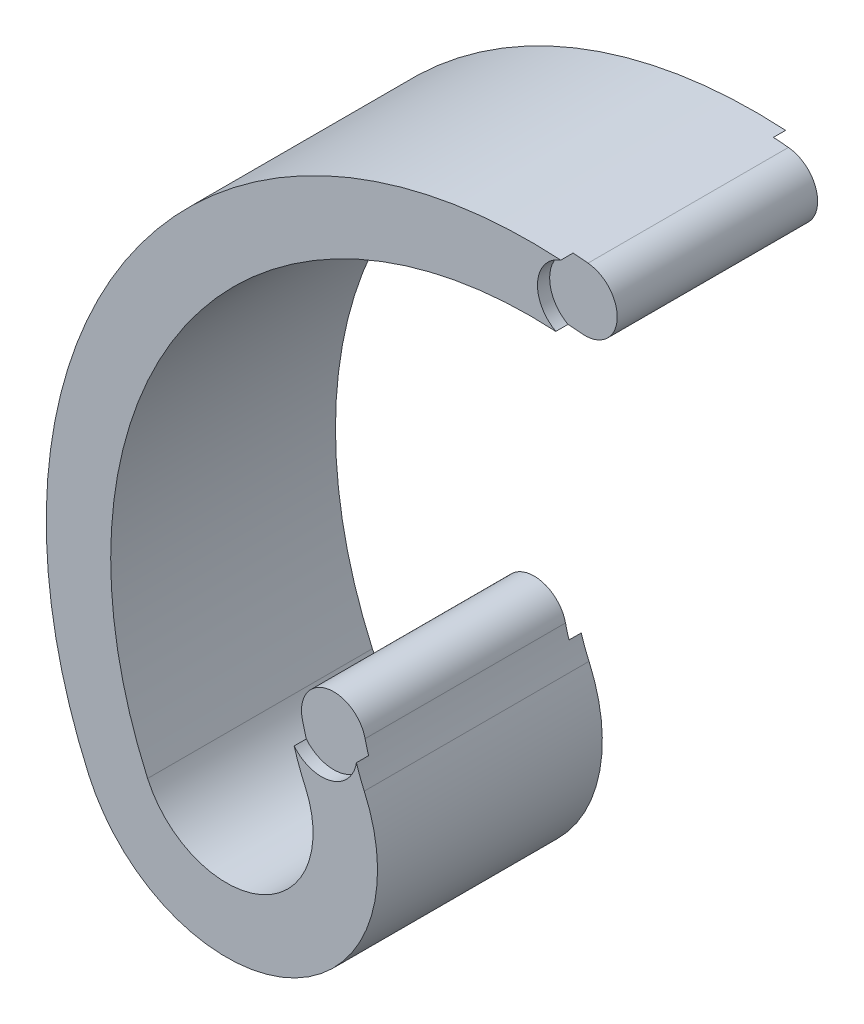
ISO-10303-21;
HEADER;
FILE_DESCRIPTION(('STEP AP214'),'2;1');
FILE_NAME('part.step','',(''),(''),'','','');
FILE_SCHEMA(('AUTOMOTIVE_DESIGN { 1 0 10303 214 1 1 1 1 }'));
ENDSEC;
DATA;
#1=APPLICATION_CONTEXT('core data for automotive mechanical design processes');
#2=APPLICATION_PROTOCOL_DEFINITION('international standard','automotive_design',2000,#1);
#3=PRODUCT_CONTEXT('',#1,'mechanical');
#4=PRODUCT('Part','Part','',(#3));
#5=PRODUCT_RELATED_PRODUCT_CATEGORY('part','',(#4));
#6=PRODUCT_DEFINITION_FORMATION('','',#4);
#7=PRODUCT_DEFINITION_CONTEXT('part definition',#1,'design');
#8=PRODUCT_DEFINITION('design','',#6,#7);
#9=PRODUCT_DEFINITION_SHAPE('','',#8);
#10=(LENGTH_UNIT() NAMED_UNIT(*) SI_UNIT(.MILLI.,.METRE.));
#11=(NAMED_UNIT(*) PLANE_ANGLE_UNIT() SI_UNIT($,.RADIAN.));
#12=(NAMED_UNIT(*) SI_UNIT($,.STERADIAN.) SOLID_ANGLE_UNIT());
#13=UNCERTAINTY_MEASURE_WITH_UNIT(LENGTH_MEASURE(1.E-05),#10,'distance_accuracy_value','');
#14=(GEOMETRIC_REPRESENTATION_CONTEXT(3) GLOBAL_UNCERTAINTY_ASSIGNED_CONTEXT((#13)) GLOBAL_UNIT_ASSIGNED_CONTEXT((#10,
#11,#12)) REPRESENTATION_CONTEXT('',''));
#15=CARTESIAN_POINT('',(0.,0.,0.));
#16=DIRECTION('',(0.,0.,1.));
#17=DIRECTION('',(1.,0.,0.));
#18=AXIS2_PLACEMENT_3D('',#15,#16,#17);
#19=CARTESIAN_POINT('',(0.,0.,-143.));
#20=DIRECTION('',(0.,0.,1.));
#21=DIRECTION('',(1.,0.,0.));
#22=AXIS2_PLACEMENT_3D('',#19,#20,#21);
#23=PLANE('',#22);
#24=CARTESIAN_POINT('',(53.7730891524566,572.778059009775,-143.));
#25=DIRECTION('',(0.,0.,1.));
#26=DIRECTION('',(1.,0.,0.));
#27=AXIS2_PLACEMENT_3D('',#24,#25,#26);
#28=CIRCLE('',#27,45.0000000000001);
#29=CARTESIAN_POINT('',(38.467009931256,615.095005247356,-143.));
#30=VERTEX_POINT('',#29);
#31=CARTESIAN_POINT('',(32.1194930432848,533.330349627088,-143.));
#32=VERTEX_POINT('',#31);
#33=EDGE_CURVE('E138',#30,#32,#28,.T.);
#34=ORIENTED_EDGE('',*,*,#33,.T.);
#35=CARTESIAN_POINT('',(0.,0.,-143.));
#36=DIRECTION('',(0.,0.,1.));
#37=DIRECTION('',(1.,0.,0.));
#38=AXIS2_PLACEMENT_3D('',#35,#36,#37);
#39=CIRCLE('',#38,534.296662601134);
#40=CARTESIAN_POINT('',(-487.342733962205,-219.020508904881,-143.));
#41=VERTEX_POINT('',#40);
#42=EDGE_CURVE('E157',#32,#41,#39,.T.);
#43=ORIENTED_EDGE('',*,*,#42,.T.);
#44=CARTESIAN_POINT('',(-386.881951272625,-173.871642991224,-143.));
#45=DIRECTION('',(0.,0.,1.));
#46=DIRECTION('',(1.,0.,0.));
#47=AXIS2_PLACEMENT_3D('',#44,#45,#46);
#48=CIRCLE('',#47,110.13986086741);
#49=CARTESIAN_POINT('',(-286.421168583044,-128.722777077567,-143.));
#50=VERTEX_POINT('',#49);
#51=EDGE_CURVE('E161',#41,#50,#48,.T.);
#52=ORIENTED_EDGE('',*,*,#51,.T.);
#53=CARTESIAN_POINT('',(0.,0.,-143.));
#54=DIRECTION('',(0.,0.,1.));
#55=DIRECTION('',(1.,0.,0.));
#56=AXIS2_PLACEMENT_3D('',#53,#54,#55);
#57=CIRCLE('',#56,314.016940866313);
#58=CARTESIAN_POINT('',(-300.853975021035,-89.9640198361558,-143.));
#59=VERTEX_POINT('',#58);
#60=EDGE_CURVE('E256',#50,#59,#57,.F.);
#61=ORIENTED_EDGE('',*,*,#60,.T.);
#62=CARTESIAN_POINT('',(-266.,-61.4999999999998,-143.));
#63=DIRECTION('',(0.,0.,1.));
#64=DIRECTION('',(1.,0.,0.));
#65=AXIS2_PLACEMENT_3D('',#62,#63,#64);
#66=CIRCLE('',#65,45.);
#67=CARTESIAN_POINT('',(-221.591071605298,-68.7695996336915,-143.));
#68=VERTEX_POINT('',#67);
#69=EDGE_CURVE('E275',#59,#68,#66,.T.);
#70=ORIENTED_EDGE('',*,*,#69,.T.);
#71=CARTESIAN_POINT('',(0.,0.,-143.));
#72=DIRECTION('',(0.,0.,1.));
#73=DIRECTION('',(1.,0.,0.));
#74=AXIS2_PLACEMENT_3D('',#71,#72,#73);
#75=CIRCLE('',#74,232.016940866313);
#76=CARTESIAN_POINT('',(-211.627319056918,-95.1090883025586,-143.));
#77=VERTEX_POINT('',#76);
#78=EDGE_CURVE('E253',#77,#68,#75,.F.);
#79=ORIENTED_EDGE('',*,*,#78,.F.);
#80=CARTESIAN_POINT('',(-386.881951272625,-173.871642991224,-143.));
#81=DIRECTION('',(0.,0.,1.));
#82=DIRECTION('',(1.,0.,0.));
#83=AXIS2_PLACEMENT_3D('',#80,#81,#82);
#84=CIRCLE('',#83,192.13986086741);
#85=CARTESIAN_POINT('',(-562.136583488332,-252.63419767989,-143.));
#86=VERTEX_POINT('',#85);
#87=EDGE_CURVE('E156',#86,#77,#84,.T.);
#88=ORIENTED_EDGE('',*,*,#87,.F.);
#89=CARTESIAN_POINT('',(0.,0.,-143.));
#90=DIRECTION('',(0.,0.,1.));
#91=DIRECTION('',(1.,0.,0.));
#92=AXIS2_PLACEMENT_3D('',#89,#90,#91);
#93=CIRCLE('',#92,616.296662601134);
#94=EDGE_CURVE('E151',#30,#86,#93,.T.);
#95=ORIENTED_EDGE('',*,*,#94,.F.);
#96=EDGE_LOOP('',(#34,#43,#52,#61,#70,#79,#88,#95));
#97=FACE_BOUND('',#96,.T.);
#98=ADVANCED_FACE('F26',(#97),#23,.F.);
#99=CARTESIAN_POINT('',(53.7730891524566,572.778059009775,-258.965512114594));
#100=DIRECTION('',(0.,0.,1.));
#101=DIRECTION('',(1.,0.,0.));
#102=AXIS2_PLACEMENT_3D('',#99,#100,#101);
#103=CYLINDRICAL_SURFACE('',#102,41.0000000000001);
#104=DIRECTION('',(0.,0.,-1.));
#105=VECTOR('',#104,1.);
#106=CARTESIAN_POINT('',(49.9408113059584,531.957553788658,143.));
#107=LINE('',#106,#105);
#108=CARTESIAN_POINT('',(49.9408113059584,531.957553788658,127.5));
#109=VERTEX_POINT('',#108);
#110=CARTESIAN_POINT('',(49.9408113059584,531.957553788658,-127.5));
#111=VERTEX_POINT('',#110);
#112=EDGE_CURVE('E186',#109,#111,#107,.T.);
#113=ORIENTED_EDGE('',*,*,#112,.T.);
#114=CARTESIAN_POINT('',(53.7730891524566,572.778059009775,-127.5));
#115=DIRECTION('',(0.,0.,-1.));
#116=DIRECTION('',(-1.,0.,0.));
#117=AXIS2_PLACEMENT_3D('',#114,#115,#116);
#118=CIRCLE('',#117,41.0000000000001);
#119=CARTESIAN_POINT('',(57.605366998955,613.598564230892,-127.5));
#120=VERTEX_POINT('',#119);
#121=EDGE_CURVE('E210',#111,#120,#118,.F.);
#122=ORIENTED_EDGE('',*,*,#121,.T.);
#123=DIRECTION('',(0.,0.,-1.));
#124=VECTOR('',#123,1.);
#125=CARTESIAN_POINT('',(57.605366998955,613.598564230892,143.));
#126=LINE('',#125,#124);
#127=CARTESIAN_POINT('',(57.605366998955,613.598564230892,127.5));
#128=VERTEX_POINT('',#127);
#129=EDGE_CURVE('E184',#128,#120,#126,.T.);
#130=ORIENTED_EDGE('',*,*,#129,.F.);
#131=CARTESIAN_POINT('',(53.7730891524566,572.778059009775,127.5));
#132=DIRECTION('',(0.,0.,1.));
#133=DIRECTION('',(1.,0.,0.));
#134=AXIS2_PLACEMENT_3D('',#131,#132,#133);
#135=CIRCLE('',#134,41.0000000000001);
#136=EDGE_CURVE('E203',#128,#109,#135,.F.);
#137=ORIENTED_EDGE('',*,*,#136,.T.);
#138=EDGE_LOOP('',(#113,#122,#130,#137));
#139=FACE_BOUND('',#138,.T.);
#140=ADVANCED_FACE('F214',(#139),#103,.T.);
#141=CARTESIAN_POINT('',(0.,0.,143.));
#142=DIRECTION('',(0.,0.,-1.));
#143=DIRECTION('',(-1.,0.,0.));
#144=AXIS2_PLACEMENT_3D('',#141,#142,#143);
#145=CYLINDRICAL_SURFACE('',#144,534.296662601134);
#146=ORIENTED_EDGE('',*,*,#42,.F.);
#147=DIRECTION('',(0.,0.,-1.));
#148=VECTOR('',#147,1.);
#149=CARTESIAN_POINT('',(32.1194930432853,533.330349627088,-135.25));
#150=LINE('',#149,#148);
#151=CARTESIAN_POINT('',(32.1194930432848,533.330349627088,-127.5));
#152=VERTEX_POINT('',#151);
#153=EDGE_CURVE('E143',#32,#152,#150,.F.);
#154=ORIENTED_EDGE('',*,*,#153,.T.);
#155=CARTESIAN_POINT('',(0.,0.,-127.5));
#156=DIRECTION('',(0.,0.,-1.));
#157=DIRECTION('',(-1.,0.,0.));
#158=AXIS2_PLACEMENT_3D('',#155,#156,#157);
#159=CIRCLE('',#158,534.296662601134);
#160=EDGE_CURVE('E216',#152,#111,#159,.T.);
#161=ORIENTED_EDGE('',*,*,#160,.T.);
#162=ORIENTED_EDGE('',*,*,#112,.F.);
#163=CARTESIAN_POINT('',(0.,0.,127.5));
#164=DIRECTION('',(0.,0.,1.));
#165=DIRECTION('',(1.,0.,0.));
#166=AXIS2_PLACEMENT_3D('',#163,#164,#165);
#167=CIRCLE('',#166,534.296662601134);
#168=CARTESIAN_POINT('',(32.1194930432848,533.330349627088,127.5));
#169=VERTEX_POINT('',#168);
#170=EDGE_CURVE('E226',#109,#169,#167,.T.);
#171=ORIENTED_EDGE('',*,*,#170,.T.);
#172=DIRECTION('',(0.,0.,1.));
#173=VECTOR('',#172,1.);
#174=CARTESIAN_POINT('',(32.1194930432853,533.330349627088,135.25));
#175=LINE('',#174,#173);
#176=CARTESIAN_POINT('',(32.1194930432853,533.330349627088,143.));
#177=VERTEX_POINT('',#176);
#178=EDGE_CURVE('E236',#177,#169,#175,.F.);
#179=ORIENTED_EDGE('',*,*,#178,.F.);
#180=CARTESIAN_POINT('',(0.,0.,143.));
#181=DIRECTION('',(0.,0.,1.));
#182=DIRECTION('',(1.,0.,0.));
#183=AXIS2_PLACEMENT_3D('',#180,#181,#182);
#184=CIRCLE('',#183,534.296662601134);
#185=CARTESIAN_POINT('',(-487.342733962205,-219.020508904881,143.));
#186=VERTEX_POINT('',#185);
#187=EDGE_CURVE('E173',#177,#186,#184,.T.);
#188=ORIENTED_EDGE('',*,*,#187,.T.);
#189=DIRECTION('',(0.,0.,-1.));
#190=VECTOR('',#189,1.);
#191=CARTESIAN_POINT('',(-487.342733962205,-219.020508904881,143.));
#192=LINE('',#191,#190);
#193=EDGE_CURVE('E189',#186,#41,#192,.T.);
#194=ORIENTED_EDGE('',*,*,#193,.T.);
#195=EDGE_LOOP('',(#146,#154,#161,#162,#171,#179,#188,#194));
#196=FACE_BOUND('',#195,.T.);
#197=ADVANCED_FACE('F289',(#196),#145,.F.);
#198=CARTESIAN_POINT('',(0.,0.,143.));
#199=DIRECTION('',(0.,0.,-1.));
#200=DIRECTION('',(-1.,0.,0.));
#201=AXIS2_PLACEMENT_3D('',#198,#199,#200);
#202=CYLINDRICAL_SURFACE('',#201,616.296662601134);
#203=DIRECTION('',(0.,0.,-1.));
#204=VECTOR('',#203,1.);
#205=CARTESIAN_POINT('',(38.4670099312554,615.095005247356,-135.25));
#206=LINE('',#205,#204);
#207=CARTESIAN_POINT('',(38.467009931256,615.095005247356,-127.5));
#208=VERTEX_POINT('',#207);
#209=EDGE_CURVE('E11',#30,#208,#206,.F.);
#210=ORIENTED_EDGE('',*,*,#209,.F.);
#211=ORIENTED_EDGE('',*,*,#94,.T.);
#212=DIRECTION('',(0.,0.,-1.));
#213=VECTOR('',#212,1.);
#214=CARTESIAN_POINT('',(-562.136583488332,-252.63419767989,143.));
#215=LINE('',#214,#213);
#216=CARTESIAN_POINT('',(-562.136583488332,-252.63419767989,143.));
#217=VERTEX_POINT('',#216);
#218=EDGE_CURVE('E182',#217,#86,#215,.T.);
#219=ORIENTED_EDGE('',*,*,#218,.F.);
#220=CARTESIAN_POINT('',(0.,0.,143.));
#221=DIRECTION('',(0.,0.,1.));
#222=DIRECTION('',(1.,0.,0.));
#223=AXIS2_PLACEMENT_3D('',#220,#221,#222);
#224=CIRCLE('',#223,616.296662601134);
#225=CARTESIAN_POINT('',(38.4670099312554,615.095005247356,143.));
#226=VERTEX_POINT('',#225);
#227=EDGE_CURVE('E175',#226,#217,#224,.T.);
#228=ORIENTED_EDGE('',*,*,#227,.F.);
#229=DIRECTION('',(0.,0.,1.));
#230=VECTOR('',#229,1.);
#231=CARTESIAN_POINT('',(38.4670099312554,615.095005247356,135.25));
#232=LINE('',#231,#230);
#233=CARTESIAN_POINT('',(38.467009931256,615.095005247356,127.5));
#234=VERTEX_POINT('',#233);
#235=EDGE_CURVE('E222',#226,#234,#232,.F.);
#236=ORIENTED_EDGE('',*,*,#235,.T.);
#237=CARTESIAN_POINT('',(0.,0.,127.5));
#238=DIRECTION('',(0.,0.,1.));
#239=DIRECTION('',(1.,0.,0.));
#240=AXIS2_PLACEMENT_3D('',#237,#238,#239);
#241=CIRCLE('',#240,616.296662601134);
#242=EDGE_CURVE('E220',#128,#234,#241,.T.);
#243=ORIENTED_EDGE('',*,*,#242,.F.);
#244=ORIENTED_EDGE('',*,*,#129,.T.);
#245=CARTESIAN_POINT('',(0.,0.,-127.5));
#246=DIRECTION('',(0.,0.,-1.));
#247=DIRECTION('',(-1.,0.,0.));
#248=AXIS2_PLACEMENT_3D('',#245,#246,#247);
#249=CIRCLE('',#248,616.296662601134);
#250=EDGE_CURVE('E34',#208,#120,#249,.T.);
#251=ORIENTED_EDGE('',*,*,#250,.F.);
#252=EDGE_LOOP('',(#210,#211,#219,#228,#236,#243,#244,#251));
#253=FACE_BOUND('',#252,.T.);
#254=ADVANCED_FACE('F149',(#253),#202,.T.);
#255=CARTESIAN_POINT('',(-266.,-61.4999999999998,-258.965512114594));
#256=DIRECTION('',(0.,0.,1.));
#257=DIRECTION('',(1.,0.,0.));
#258=AXIS2_PLACEMENT_3D('',#255,#256,#257);
#259=CYLINDRICAL_SURFACE('',#258,41.);
#260=DIRECTION('',(0.,0.,-1.));
#261=VECTOR('',#260,1.);
#262=CARTESIAN_POINT('',(-226.053760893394,-52.2643093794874,143.));
#263=LINE('',#262,#261);
#264=CARTESIAN_POINT('',(-226.053760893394,-52.2643093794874,127.5));
#265=VERTEX_POINT('',#264);
#266=CARTESIAN_POINT('',(-226.053760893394,-52.2643093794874,-127.5));
#267=VERTEX_POINT('',#266);
#268=EDGE_CURVE('E197',#265,#267,#263,.T.);
#269=ORIENTED_EDGE('',*,*,#268,.T.);
#270=CARTESIAN_POINT('',(-266.,-61.4999999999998,-127.5));
#271=DIRECTION('',(0.,0.,-1.));
#272=DIRECTION('',(-1.,0.,0.));
#273=AXIS2_PLACEMENT_3D('',#270,#271,#272);
#274=CIRCLE('',#273,41.);
#275=CARTESIAN_POINT('',(-305.946239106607,-70.7356906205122,-127.5));
#276=VERTEX_POINT('',#275);
#277=EDGE_CURVE('E273',#267,#276,#274,.F.);
#278=ORIENTED_EDGE('',*,*,#277,.T.);
#279=DIRECTION('',(0.,0.,-1.));
#280=VECTOR('',#279,1.);
#281=CARTESIAN_POINT('',(-305.946239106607,-70.7356906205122,143.));
#282=LINE('',#281,#280);
#283=CARTESIAN_POINT('',(-305.946239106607,-70.7356906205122,127.5));
#284=VERTEX_POINT('',#283);
#285=EDGE_CURVE('E194',#284,#276,#282,.T.);
#286=ORIENTED_EDGE('',*,*,#285,.F.);
#287=CARTESIAN_POINT('',(-266.,-61.4999999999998,127.5));
#288=DIRECTION('',(0.,0.,1.));
#289=DIRECTION('',(1.,0.,0.));
#290=AXIS2_PLACEMENT_3D('',#287,#288,#289);
#291=CIRCLE('',#290,41.);
#292=EDGE_CURVE('E200',#284,#265,#291,.F.);
#293=ORIENTED_EDGE('',*,*,#292,.T.);
#294=EDGE_LOOP('',(#269,#278,#286,#293));
#295=FACE_BOUND('',#294,.T.);
#296=ADVANCED_FACE('F305',(#295),#259,.T.);
#297=CARTESIAN_POINT('',(0.,0.,143.));
#298=DIRECTION('',(0.,0.,-1.));
#299=DIRECTION('',(-1.,0.,0.));
#300=AXIS2_PLACEMENT_3D('',#297,#298,#299);
#301=CYLINDRICAL_SURFACE('',#300,232.016940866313);
#302=DIRECTION('',(0.,0.,-1.));
#303=VECTOR('',#302,1.);
#304=CARTESIAN_POINT('',(-221.591071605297,-68.7695996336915,-135.25));
#305=LINE('',#304,#303);
#306=CARTESIAN_POINT('',(-221.591071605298,-68.7695996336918,-127.5));
#307=VERTEX_POINT('',#306);
#308=EDGE_CURVE('E48',#307,#68,#305,.T.);
#309=ORIENTED_EDGE('',*,*,#308,.F.);
#310=CARTESIAN_POINT('',(0.,0.,-127.5));
#311=DIRECTION('',(0.,0.,-1.));
#312=DIRECTION('',(-1.,0.,0.));
#313=AXIS2_PLACEMENT_3D('',#310,#311,#312);
#314=CIRCLE('',#313,232.016940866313);
#315=EDGE_CURVE('E281',#267,#307,#314,.F.);
#316=ORIENTED_EDGE('',*,*,#315,.F.);
#317=ORIENTED_EDGE('',*,*,#268,.F.);
#318=CARTESIAN_POINT('',(0.,0.,127.5));
#319=DIRECTION('',(0.,0.,1.));
#320=DIRECTION('',(1.,0.,0.));
#321=AXIS2_PLACEMENT_3D('',#318,#319,#320);
#322=CIRCLE('',#321,232.016940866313);
#323=CARTESIAN_POINT('',(-221.591071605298,-68.7695996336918,127.5));
#324=VERTEX_POINT('',#323);
#325=EDGE_CURVE('E246',#324,#265,#322,.F.);
#326=ORIENTED_EDGE('',*,*,#325,.F.);
#327=DIRECTION('',(0.,0.,1.));
#328=VECTOR('',#327,1.);
#329=CARTESIAN_POINT('',(-221.591071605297,-68.7695996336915,135.25));
#330=LINE('',#329,#328);
#331=CARTESIAN_POINT('',(-221.591071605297,-68.7695996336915,143.));
#332=VERTEX_POINT('',#331);
#333=EDGE_CURVE('E250',#324,#332,#330,.T.);
#334=ORIENTED_EDGE('',*,*,#333,.T.);
#335=CARTESIAN_POINT('',(0.,0.,143.));
#336=DIRECTION('',(0.,0.,1.));
#337=DIRECTION('',(1.,0.,0.));
#338=AXIS2_PLACEMENT_3D('',#335,#336,#337);
#339=CIRCLE('',#338,232.016940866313);
#340=CARTESIAN_POINT('',(-211.627319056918,-95.1090883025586,143.));
#341=VERTEX_POINT('',#340);
#342=EDGE_CURVE('E159',#341,#332,#339,.F.);
#343=ORIENTED_EDGE('',*,*,#342,.F.);
#344=DIRECTION('',(0.,0.,-1.));
#345=VECTOR('',#344,1.);
#346=CARTESIAN_POINT('',(-211.627319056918,-95.1090883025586,143.));
#347=LINE('',#346,#345);
#348=EDGE_CURVE('E179',#341,#77,#347,.T.);
#349=ORIENTED_EDGE('',*,*,#348,.T.);
#350=ORIENTED_EDGE('',*,*,#78,.T.);
#351=EDGE_LOOP('',(#309,#316,#317,#326,#334,#343,#349,#350));
#352=FACE_BOUND('',#351,.T.);
#353=ADVANCED_FACE('F28',(#352),#301,.F.);
#354=CARTESIAN_POINT('',(0.,0.,143.));
#355=DIRECTION('',(0.,0.,-1.));
#356=DIRECTION('',(-1.,0.,0.));
#357=AXIS2_PLACEMENT_3D('',#354,#355,#356);
#358=CYLINDRICAL_SURFACE('',#357,314.016940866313);
#359=CARTESIAN_POINT('',(0.,0.,-127.5));
#360=DIRECTION('',(0.,0.,-1.));
#361=DIRECTION('',(-1.,0.,0.));
#362=AXIS2_PLACEMENT_3D('',#359,#360,#361);
#363=CIRCLE('',#362,314.016940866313);
#364=CARTESIAN_POINT('',(-300.853975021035,-89.9640198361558,-127.5));
#365=VERTEX_POINT('',#364);
#366=EDGE_CURVE('E206',#276,#365,#363,.F.);
#367=ORIENTED_EDGE('',*,*,#366,.T.);
#368=DIRECTION('',(0.,0.,-1.));
#369=VECTOR('',#368,1.);
#370=CARTESIAN_POINT('',(-300.853975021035,-89.9640198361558,-135.25));
#371=LINE('',#370,#369);
#372=EDGE_CURVE('E269',#365,#59,#371,.T.);
#373=ORIENTED_EDGE('',*,*,#372,.T.);
#374=ORIENTED_EDGE('',*,*,#60,.F.);
#375=DIRECTION('',(0.,0.,-1.));
#376=VECTOR('',#375,1.);
#377=CARTESIAN_POINT('',(-286.421168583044,-128.722777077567,143.));
#378=LINE('',#377,#376);
#379=CARTESIAN_POINT('',(-286.421168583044,-128.722777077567,143.));
#380=VERTEX_POINT('',#379);
#381=EDGE_CURVE('E192',#380,#50,#378,.T.);
#382=ORIENTED_EDGE('',*,*,#381,.F.);
#383=CARTESIAN_POINT('',(0.,0.,143.));
#384=DIRECTION('',(0.,0.,1.));
#385=DIRECTION('',(1.,0.,0.));
#386=AXIS2_PLACEMENT_3D('',#383,#384,#385);
#387=CIRCLE('',#386,314.016940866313);
#388=CARTESIAN_POINT('',(-300.853975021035,-89.9640198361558,143.));
#389=VERTEX_POINT('',#388);
#390=EDGE_CURVE('E167',#380,#389,#387,.F.);
#391=ORIENTED_EDGE('',*,*,#390,.T.);
#392=DIRECTION('',(0.,0.,1.));
#393=VECTOR('',#392,1.);
#394=CARTESIAN_POINT('',(-300.853975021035,-89.9640198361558,135.25));
#395=LINE('',#394,#393);
#396=CARTESIAN_POINT('',(-300.853975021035,-89.9640198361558,127.5));
#397=VERTEX_POINT('',#396);
#398=EDGE_CURVE('E248',#397,#389,#395,.T.);
#399=ORIENTED_EDGE('',*,*,#398,.F.);
#400=CARTESIAN_POINT('',(0.,0.,127.5));
#401=DIRECTION('',(0.,0.,1.));
#402=DIRECTION('',(1.,0.,0.));
#403=AXIS2_PLACEMENT_3D('',#400,#401,#402);
#404=CIRCLE('',#403,314.016940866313);
#405=EDGE_CURVE('E243',#397,#284,#404,.F.);
#406=ORIENTED_EDGE('',*,*,#405,.T.);
#407=ORIENTED_EDGE('',*,*,#285,.T.);
#408=EDGE_LOOP('',(#367,#373,#374,#382,#391,#399,#406,#407));
#409=FACE_BOUND('',#408,.T.);
#410=ADVANCED_FACE('F268',(#409),#358,.T.);
#411=CARTESIAN_POINT('',(-386.881951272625,-173.871642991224,143.));
#412=DIRECTION('',(0.,0.,-1.));
#413=DIRECTION('',(-1.,0.,0.));
#414=AXIS2_PLACEMENT_3D('',#411,#412,#413);
#415=CYLINDRICAL_SURFACE('',#414,110.13986086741);
#416=ORIENTED_EDGE('',*,*,#51,.F.);
#417=ORIENTED_EDGE('',*,*,#193,.F.);
#418=CARTESIAN_POINT('',(-386.881951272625,-173.871642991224,143.));
#419=DIRECTION('',(0.,0.,1.));
#420=DIRECTION('',(1.,0.,0.));
#421=AXIS2_PLACEMENT_3D('',#418,#419,#420);
#422=CIRCLE('',#421,110.13986086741);
#423=EDGE_CURVE('E170',#186,#380,#422,.T.);
#424=ORIENTED_EDGE('',*,*,#423,.T.);
#425=ORIENTED_EDGE('',*,*,#381,.T.);
#426=EDGE_LOOP('',(#416,#417,#424,#425));
#427=FACE_BOUND('',#426,.T.);
#428=ADVANCED_FACE('F263',(#427),#415,.F.);
#429=CARTESIAN_POINT('',(-386.881951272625,-173.871642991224,143.));
#430=DIRECTION('',(0.,0.,-1.));
#431=DIRECTION('',(-1.,0.,0.));
#432=AXIS2_PLACEMENT_3D('',#429,#430,#431);
#433=CYLINDRICAL_SURFACE('',#432,192.13986086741);
#434=ORIENTED_EDGE('',*,*,#87,.T.);
#435=ORIENTED_EDGE('',*,*,#348,.F.);
#436=CARTESIAN_POINT('',(-386.881951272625,-173.871642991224,143.));
#437=DIRECTION('',(0.,0.,1.));
#438=DIRECTION('',(1.,0.,0.));
#439=AXIS2_PLACEMENT_3D('',#436,#437,#438);
#440=CIRCLE('',#439,192.13986086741);
#441=EDGE_CURVE('E177',#217,#341,#440,.T.);
#442=ORIENTED_EDGE('',*,*,#441,.F.);
#443=ORIENTED_EDGE('',*,*,#218,.T.);
#444=EDGE_LOOP('',(#434,#435,#442,#443));
#445=FACE_BOUND('',#444,.T.);
#446=ADVANCED_FACE('F315',(#445),#433,.T.);
#447=CARTESIAN_POINT('',(0.,0.,143.));
#448=DIRECTION('',(0.,0.,1.));
#449=DIRECTION('',(1.,0.,0.));
#450=AXIS2_PLACEMENT_3D('',#447,#448,#449);
#451=PLANE('',#450);
#452=CARTESIAN_POINT('',(53.7730891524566,572.778059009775,143.));
#453=DIRECTION('',(0.,0.,1.));
#454=DIRECTION('',(1.,0.,0.));
#455=AXIS2_PLACEMENT_3D('',#452,#453,#454);
#456=CIRCLE('',#455,45.0000000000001);
#457=EDGE_CURVE('E231',#226,#177,#456,.T.);
#458=ORIENTED_EDGE('',*,*,#457,.F.);
#459=ORIENTED_EDGE('',*,*,#227,.T.);
#460=ORIENTED_EDGE('',*,*,#441,.T.);
#461=ORIENTED_EDGE('',*,*,#342,.T.);
#462=CARTESIAN_POINT('',(-266.,-61.4999999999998,143.));
#463=DIRECTION('',(0.,0.,1.));
#464=DIRECTION('',(1.,0.,0.));
#465=AXIS2_PLACEMENT_3D('',#462,#463,#464);
#466=CIRCLE('',#465,45.);
#467=EDGE_CURVE('E238',#389,#332,#466,.T.);
#468=ORIENTED_EDGE('',*,*,#467,.F.);
#469=ORIENTED_EDGE('',*,*,#390,.F.);
#470=ORIENTED_EDGE('',*,*,#423,.F.);
#471=ORIENTED_EDGE('',*,*,#187,.F.);
#472=EDGE_LOOP('',(#458,#459,#460,#461,#468,#469,#470,#471));
#473=FACE_BOUND('',#472,.T.);
#474=ADVANCED_FACE('F290',(#473),#451,.T.);
#475=CARTESIAN_POINT('',(-266.,-61.4999999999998,127.5));
#476=DIRECTION('',(0.,0.,1.));
#477=DIRECTION('',(1.,0.,0.));
#478=AXIS2_PLACEMENT_3D('',#475,#476,#477);
#479=CYLINDRICAL_SURFACE('',#478,45.);
#480=CARTESIAN_POINT('',(-266.,-61.4999999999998,127.5));
#481=DIRECTION('',(0.,0.,1.));
#482=DIRECTION('',(1.,0.,0.));
#483=AXIS2_PLACEMENT_3D('',#480,#481,#482);
#484=CIRCLE('',#483,45.);
#485=EDGE_CURVE('E240',#397,#324,#484,.T.);
#486=ORIENTED_EDGE('',*,*,#485,.F.);
#487=ORIENTED_EDGE('',*,*,#398,.T.);
#488=ORIENTED_EDGE('',*,*,#467,.T.);
#489=ORIENTED_EDGE('',*,*,#333,.F.);
#490=EDGE_LOOP('',(#486,#487,#488,#489));
#491=FACE_BOUND('',#490,.T.);
#492=ADVANCED_FACE('F296',(#491),#479,.F.);
#493=CARTESIAN_POINT('',(-266.,-61.4999999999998,127.5));
#494=DIRECTION('',(0.,0.,1.));
#495=DIRECTION('',(1.,0.,0.));
#496=AXIS2_PLACEMENT_3D('',#493,#494,#495);
#497=PLANE('',#496);
#498=ORIENTED_EDGE('',*,*,#325,.T.);
#499=ORIENTED_EDGE('',*,*,#292,.F.);
#500=ORIENTED_EDGE('',*,*,#405,.F.);
#501=ORIENTED_EDGE('',*,*,#485,.T.);
#502=EDGE_LOOP('',(#498,#499,#500,#501));
#503=FACE_BOUND('',#502,.T.);
#504=ADVANCED_FACE('F299',(#503),#497,.T.);
#505=CARTESIAN_POINT('',(53.7730891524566,572.778059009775,127.5));
#506=DIRECTION('',(0.,0.,1.));
#507=DIRECTION('',(1.,0.,0.));
#508=AXIS2_PLACEMENT_3D('',#505,#506,#507);
#509=CYLINDRICAL_SURFACE('',#508,45.0000000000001);
#510=ORIENTED_EDGE('',*,*,#178,.T.);
#511=CARTESIAN_POINT('',(53.7730891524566,572.778059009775,127.5));
#512=DIRECTION('',(0.,0.,1.));
#513=DIRECTION('',(1.,0.,0.));
#514=AXIS2_PLACEMENT_3D('',#511,#512,#513);
#515=CIRCLE('',#514,45.0000000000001);
#516=EDGE_CURVE('E227',#234,#169,#515,.T.);
#517=ORIENTED_EDGE('',*,*,#516,.F.);
#518=ORIENTED_EDGE('',*,*,#235,.F.);
#519=ORIENTED_EDGE('',*,*,#457,.T.);
#520=EDGE_LOOP('',(#510,#517,#518,#519));
#521=FACE_BOUND('',#520,.T.);
#522=ADVANCED_FACE('F285',(#521),#509,.F.);
#523=CARTESIAN_POINT('',(53.7730891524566,572.778059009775,127.5));
#524=DIRECTION('',(0.,0.,1.));
#525=DIRECTION('',(1.,0.,0.));
#526=AXIS2_PLACEMENT_3D('',#523,#524,#525);
#527=PLANE('',#526);
#528=ORIENTED_EDGE('',*,*,#136,.F.);
#529=ORIENTED_EDGE('',*,*,#242,.T.);
#530=ORIENTED_EDGE('',*,*,#516,.T.);
#531=ORIENTED_EDGE('',*,*,#170,.F.);
#532=EDGE_LOOP('',(#528,#529,#530,#531));
#533=FACE_BOUND('',#532,.T.);
#534=ADVANCED_FACE('F341',(#533),#527,.T.);
#535=CARTESIAN_POINT('',(-266.,-61.4999999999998,-127.5));
#536=DIRECTION('',(0.,0.,-1.));
#537=DIRECTION('',(1.,0.,0.));
#538=AXIS2_PLACEMENT_3D('',#535,#536,#537);
#539=PLANE('',#538);
#540=ORIENTED_EDGE('',*,*,#315,.T.);
#541=CARTESIAN_POINT('',(-266.,-61.4999999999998,-127.5));
#542=DIRECTION('',(0.,0.,1.));
#543=DIRECTION('',(1.,0.,0.));
#544=AXIS2_PLACEMENT_3D('',#541,#542,#543);
#545=CIRCLE('',#544,45.);
#546=EDGE_CURVE('E271',#365,#307,#545,.T.);
#547=ORIENTED_EDGE('',*,*,#546,.F.);
#548=ORIENTED_EDGE('',*,*,#366,.F.);
#549=ORIENTED_EDGE('',*,*,#277,.F.);
#550=EDGE_LOOP('',(#540,#547,#548,#549));
#551=FACE_BOUND('',#550,.T.);
#552=ADVANCED_FACE('F307',(#551),#539,.T.);
#553=CARTESIAN_POINT('',(-266.,-61.4999999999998,-127.5));
#554=DIRECTION('',(0.,0.,-1.));
#555=DIRECTION('',(-1.,0.,0.));
#556=AXIS2_PLACEMENT_3D('',#553,#554,#555);
#557=CYLINDRICAL_SURFACE('',#556,45.);
#558=ORIENTED_EDGE('',*,*,#308,.T.);
#559=ORIENTED_EDGE('',*,*,#69,.F.);
#560=ORIENTED_EDGE('',*,*,#372,.F.);
#561=ORIENTED_EDGE('',*,*,#546,.T.);
#562=EDGE_LOOP('',(#558,#559,#560,#561));
#563=FACE_BOUND('',#562,.T.);
#564=ADVANCED_FACE('F308',(#563),#557,.F.);
#565=CARTESIAN_POINT('',(53.7730891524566,572.778059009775,-127.5));
#566=DIRECTION('',(0.,0.,-1.));
#567=DIRECTION('',(-1.,0.,0.));
#568=AXIS2_PLACEMENT_3D('',#565,#566,#567);
#569=CYLINDRICAL_SURFACE('',#568,45.0000000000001);
#570=ORIENTED_EDGE('',*,*,#33,.F.);
#571=ORIENTED_EDGE('',*,*,#209,.T.);
#572=CARTESIAN_POINT('',(53.7730891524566,572.778059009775,-127.5));
#573=DIRECTION('',(0.,0.,1.));
#574=DIRECTION('',(1.,0.,0.));
#575=AXIS2_PLACEMENT_3D('',#572,#573,#574);
#576=CIRCLE('',#575,45.0000000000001);
#577=EDGE_CURVE('E41',#208,#152,#576,.T.);
#578=ORIENTED_EDGE('',*,*,#577,.T.);
#579=ORIENTED_EDGE('',*,*,#153,.F.);
#580=EDGE_LOOP('',(#570,#571,#578,#579));
#581=FACE_BOUND('',#580,.T.);
#582=ADVANCED_FACE('F140',(#581),#569,.F.);
#583=CARTESIAN_POINT('',(53.7730891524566,572.778059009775,-127.5));
#584=DIRECTION('',(0.,0.,-1.));
#585=DIRECTION('',(1.,0.,0.));
#586=AXIS2_PLACEMENT_3D('',#583,#584,#585);
#587=PLANE('',#586);
#588=ORIENTED_EDGE('',*,*,#577,.F.);
#589=ORIENTED_EDGE('',*,*,#250,.T.);
#590=ORIENTED_EDGE('',*,*,#121,.F.);
#591=ORIENTED_EDGE('',*,*,#160,.F.);
#592=EDGE_LOOP('',(#588,#589,#590,#591));
#593=FACE_BOUND('',#592,.T.);
#594=ADVANCED_FACE('F209',(#593),#587,.T.);
#595=CLOSED_SHELL('',(#98,#140,#197,#254,#296,#353,#410,#428,#446,#474,#492,#504,#522,#534,#552,
#564,#582,#594));
#596=MANIFOLD_SOLID_BREP('B2',#595);
#597=ADVANCED_BREP_SHAPE_REPRESENTATION('',(#18,#596),#14);
#598=SHAPE_DEFINITION_REPRESENTATION(#9,#597);
ENDSEC;
END-ISO-10303-21;
